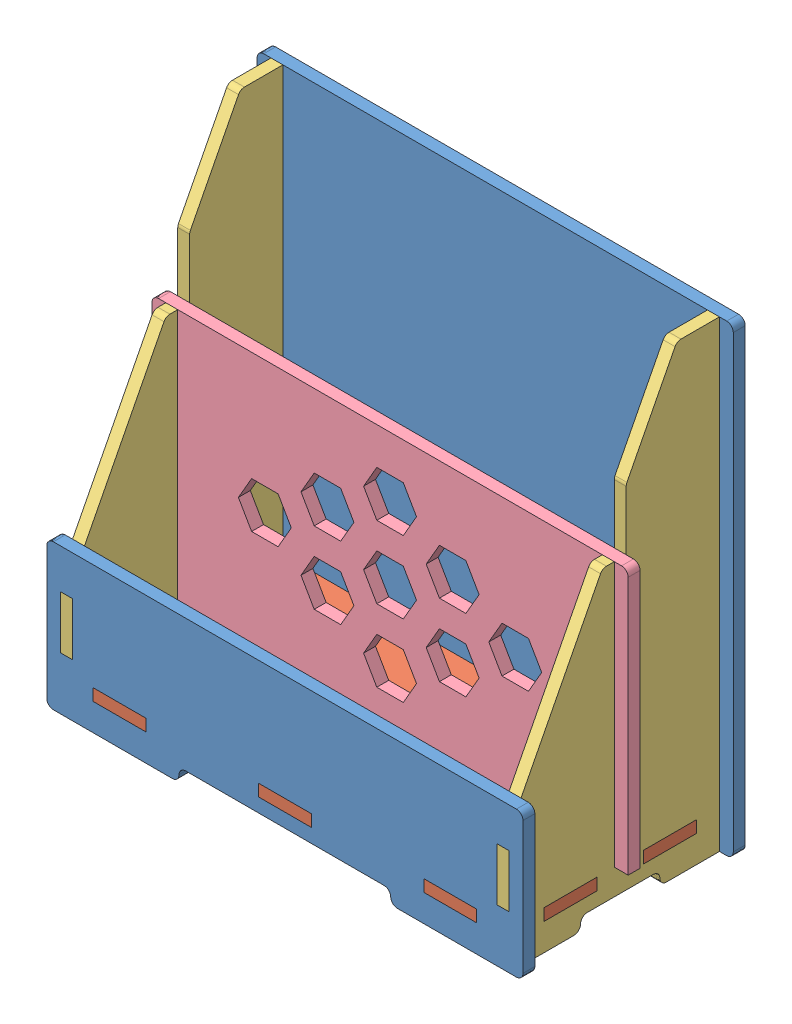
SolidWorks assembly Assieme.SLDASM, configuration Default (file format 9000). Lengths in mm.
Overall size (720 700 336).
6 component instances, 4 part files, 15 mates.
Components (placement in the parent):
- front panel-1: front panel.SLDPRT [Default] at (21.5329 -41.8748 711) size (720 220 18)
- base-1: base.SLDPRT [Default] at (21.5329 -120.8748 561) x (1 0 0) z (0 1 0) size (678 336 18)
- front panel-2: front panel.SLDPRT [back] at (21.5329 -41.8748 393) size (720 700 18)
- side-1: side.SLDPRT [Default] at (-299.4671 188.1252 561) x (0 0 1) z (-1 0 0) size (336 700 18)
- side-2: side.SLDPRT [Default] at (360.5329 188.1252 561) x (0 0 1) z (-1 0 0) size (336 700 18)
- middle-1: middle.SLDPRT [Default] at (21.5329 97.1252 552) size (720 418 18)
Mates (geometry in assembly coordinates):
- Coincidente1: coincident aligned: plane of front panel-1 through (21.5329 -41.8748 729) normal (0 0 1); plane of base-1 through (-268.4671 -120.8748 729) normal (0 0 1)
- Coincidente2: coincident aligned: plane of front panel-1 through (-299.4671 -1.8748 711) normal (-1 0 0); plane of base-1 through (-299.4671 -102.8748 411) normal (-1 0 0)
- Coincidente3: coincident anti-aligned: plane of front panel-1 through (-268.4671 -120.8748 711) normal (0 1 0); plane of base-1 through (21.5329 -120.8748 561) normal (0 -1 0)
- Coincidente4: coincident anti-aligned: plane of base-1 through (-299.4671 -102.8748 411) normal (0 0 -1); plane of front panel-2 through (21.5329 -41.8748 411) normal (0 0 1)
- Coincidente5: coincident anti-aligned: plane of base-1 through (21.5329 -102.8748 561) normal (0 1 0); plane of front panel-2 through (-268.4671 -102.8748 393) normal (0 -1 0)
- Coincidente6: coincident anti-aligned: plane of base-1 through (-188.4671 -120.8748 393) normal (1 0 0); plane of front panel-2 through (-188.4671 -102.8748 393) normal (-1 0 0)
- Coincidente7: coincident anti-aligned: plane of base-1 through (-299.4671 -102.8748 411) normal (-1 0 0); plane of side-1 through (-299.4671 188.1252 561) normal (1 0 0)
- Coincidente8: coincident anti-aligned: plane of front panel-1 through (-299.4671 -81.8748 711) normal (0 1 0); plane of side-1 through (-299.4671 -81.8748 711) normal (0 -1 0)
- Coincidente9: coincident anti-aligned: plane of front panel-1 through (21.5329 -41.8748 711) normal (0 0 -1); plane of side-1 through (-317.4671 -161.8748 711) normal (0 0 1)
- Coincidente10: coincident anti-aligned: plane of base-1 through (342.5329 -102.8748 411) normal (1 0 0); plane of side-2 through (342.5329 188.1252 561) normal (-1 0 0)
- Coincidente11: coincident anti-aligned: plane of base-1 through (21.5329 -120.8748 561) normal (0 -1 0); plane of side-2 through (342.5329 -120.8748 676) normal (0 1 0)
- Coincidente12: coincident anti-aligned: plane of base-1 through (360.5329 -120.8748 596) normal (0 0 -1); plane of side-2 through (342.5329 -102.8748 596) normal (0 0 1)
- Coincidente13: coincident anti-aligned: plane of base-1 through (-18.4671 -120.8748 570) normal (0 0 -1); plane of middle-1 through (21.5329 97.1252 570) normal (0 0 1)
- Coincidente14: coincident aligned: plane of base-1 through (21.5329 -120.8748 561) normal (0 -1 0); plane of middle-1 through (-218.4671 -120.8748 552) normal (0 -1 0)
- Coincidente15: coincident anti-aligned: plane of base-1 through (-218.4671 -120.8748 552) normal (1 0 0); plane of middle-1 through (-218.4671 -120.8748 552) normal (-1 0 0)
